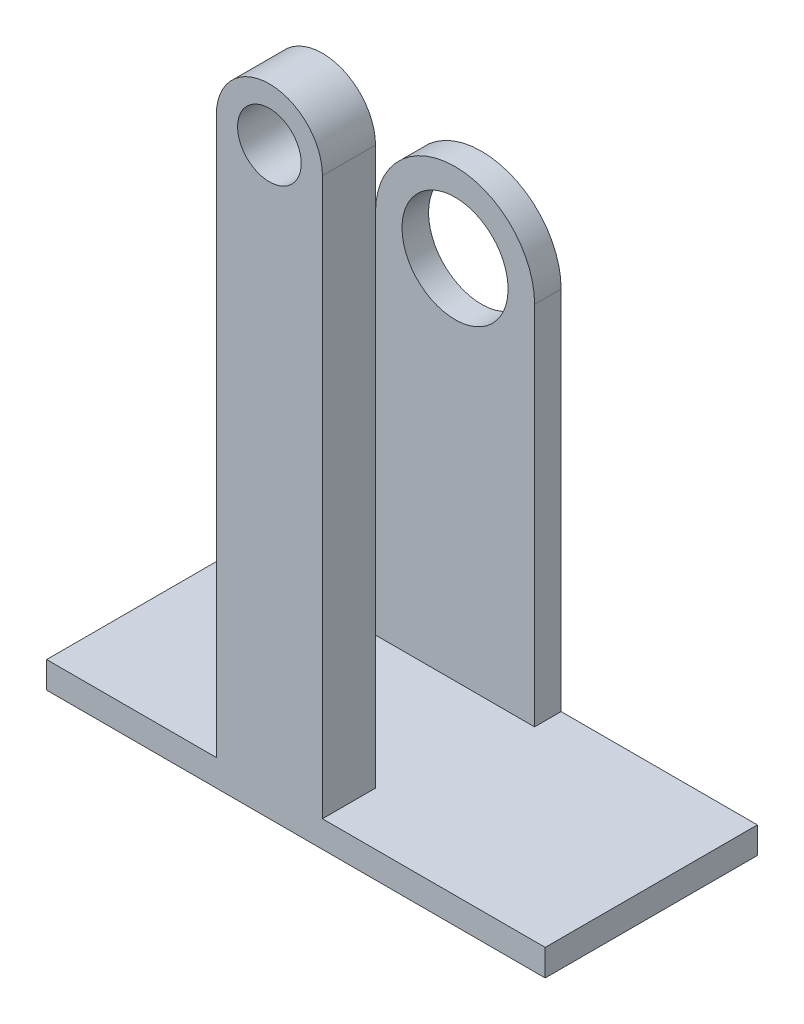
from build123d import *

# Parameters (mm, degrees)
ESQUISSE1_R      = 10
ESQUISSE1_R_2    = 6
EXTRUSION1_DEPTH = 10
EXTRUSION6_START = -10
EXTRUSION6_DEPTH = 10
ESQUISSE6_W      = 94
ESQUISSE6_H      = 5
EXTRUSION7_DEPTH = 40
ESQUISSE7_R      = 10
EXTRUSION8_DEPTH = 5


with BuildPart() as part:
    # Esquisse1 → Extrusion1 (new body)
    with BuildSketch(Plane.XY):
        with Locations((0, 36)):
            Circle(ESQUISSE1_R)
        with Locations((0, 36)):
            Circle(ESQUISSE1_R_2, mode=Mode.SUBTRACT)
    extrude(amount=EXTRUSION1_DEPTH)

    # Esquisse5 → Extrusion6 (add)
    with BuildSketch(Plane.XY.offset(10).offset(EXTRUSION6_START)):
        with BuildLine():
            Line((-10, 36), (-10, -74))
            Line((-10, -74), (10, -74))
            Line((10, -74), (10, 36))
            ThreePointArc((10, 36), (0, 26), (-10, 36))
        make_face()
    extrude(amount=EXTRUSION6_DEPTH)

    # Esquisse6 → Extrusion7 (add)
    with BuildSketch(Plane.XY.offset(10)):
        with Locations((5, -71.5)):
            Rectangle(ESQUISSE6_W, ESQUISSE6_H)
    extrude(amount=-EXTRUSION7_DEPTH)

    # Esquisse7 → Extrusion8 (add)
    with BuildSketch(Plane(origin=(0, 0, -30), x_dir=(-1, 0, 0), z_dir=(0, 0, -1))):
        with BuildLine():
            Line((-15, 0), (-15, -74))
            Line((-15, -74), (15, -74))
            Line((15, -74), (15, 0))
            ThreePointArc((15, 0), (0, 15), (-15, 0))
        make_face()
        Circle(ESQUISSE7_R, mode=Mode.SUBTRACT)
    extrude(amount=-EXTRUSION8_DEPTH)


solid = part.part
